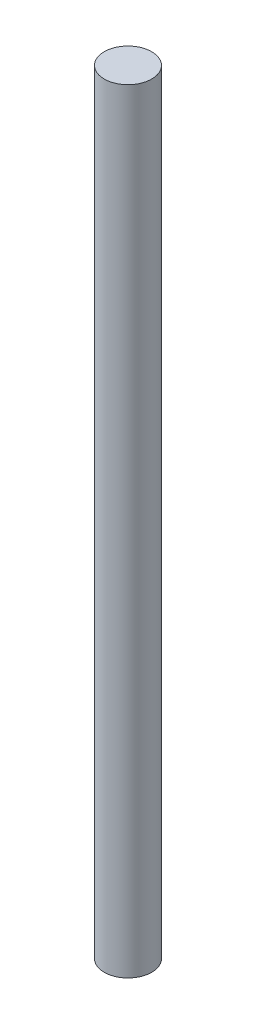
ISO-10303-21;
HEADER;
FILE_DESCRIPTION(('STEP AP214'),'2;1');
FILE_NAME('part.step','',(''),(''),'','','');
FILE_SCHEMA(('AUTOMOTIVE_DESIGN { 1 0 10303 214 1 1 1 1 }'));
ENDSEC;
DATA;
#1=APPLICATION_CONTEXT('core data for automotive mechanical design processes');
#2=APPLICATION_PROTOCOL_DEFINITION('international standard','automotive_design',2000,#1);
#3=PRODUCT_CONTEXT('',#1,'mechanical');
#4=PRODUCT('Part','Part','',(#3));
#5=PRODUCT_RELATED_PRODUCT_CATEGORY('part','',(#4));
#6=PRODUCT_DEFINITION_FORMATION('','',#4);
#7=PRODUCT_DEFINITION_CONTEXT('part definition',#1,'design');
#8=PRODUCT_DEFINITION('design','',#6,#7);
#9=PRODUCT_DEFINITION_SHAPE('','',#8);
#10=(LENGTH_UNIT() NAMED_UNIT(*) SI_UNIT(.MILLI.,.METRE.));
#11=(NAMED_UNIT(*) PLANE_ANGLE_UNIT() SI_UNIT($,.RADIAN.));
#12=(NAMED_UNIT(*) SI_UNIT($,.STERADIAN.) SOLID_ANGLE_UNIT());
#13=UNCERTAINTY_MEASURE_WITH_UNIT(LENGTH_MEASURE(1.E-05),#10,'distance_accuracy_value','');
#14=(GEOMETRIC_REPRESENTATION_CONTEXT(3) GLOBAL_UNCERTAINTY_ASSIGNED_CONTEXT((#13)) GLOBAL_UNIT_ASSIGNED_CONTEXT((#10,
#11,#12)) REPRESENTATION_CONTEXT('',''));
#15=CARTESIAN_POINT('',(0.,0.,0.));
#16=DIRECTION('',(0.,0.,1.));
#17=DIRECTION('',(1.,0.,0.));
#18=AXIS2_PLACEMENT_3D('',#15,#16,#17);
#19=CARTESIAN_POINT('',(0.,393.7,0.));
#20=DIRECTION('',(0.,-1.,0.));
#21=DIRECTION('',(0.,0.,-1.));
#22=AXIS2_PLACEMENT_3D('',#19,#20,#21);
#23=CYLINDRICAL_SURFACE('',#22,12.065);
#24=CARTESIAN_POINT('',(0.,393.7,0.));
#25=DIRECTION('',(0.,1.,0.));
#26=DIRECTION('',(0.,0.,1.));
#27=AXIS2_PLACEMENT_3D('',#24,#25,#26);
#28=CIRCLE('',#27,12.065);
#29=CARTESIAN_POINT('',(0.,393.7,12.065));
#30=VERTEX_POINT('',#29);
#31=EDGE_CURVE('E12',#30,#30,#28,.T.);
#32=ORIENTED_EDGE('',*,*,#31,.F.);
#33=EDGE_LOOP('',(#32));
#34=FACE_BOUND('',#33,.T.);
#35=CARTESIAN_POINT('',(0.,0.,0.));
#36=DIRECTION('',(0.,1.,0.));
#37=DIRECTION('',(0.,0.,1.));
#38=AXIS2_PLACEMENT_3D('',#35,#36,#37);
#39=CIRCLE('',#38,12.065);
#40=CARTESIAN_POINT('',(0.,0.,12.065));
#41=VERTEX_POINT('',#40);
#42=EDGE_CURVE('E48',#41,#41,#39,.T.);
#43=ORIENTED_EDGE('',*,*,#42,.T.);
#44=EDGE_LOOP('',(#43));
#45=FACE_BOUND('',#44,.T.);
#46=ADVANCED_FACE('F45',(#34,#45),#23,.T.);
#47=CARTESIAN_POINT('',(0.,393.7,0.));
#48=DIRECTION('',(0.,1.,0.));
#49=DIRECTION('',(0.,0.,1.));
#50=AXIS2_PLACEMENT_3D('',#47,#48,#49);
#51=PLANE('',#50);
#52=ORIENTED_EDGE('',*,*,#31,.T.);
#53=EDGE_LOOP('',(#52));
#54=FACE_BOUND('',#53,.T.);
#55=ADVANCED_FACE('F60',(#54),#51,.T.);
#56=CARTESIAN_POINT('',(0.,0.,0.));
#57=DIRECTION('',(0.,1.,0.));
#58=DIRECTION('',(0.,0.,1.));
#59=AXIS2_PLACEMENT_3D('',#56,#57,#58);
#60=PLANE('',#59);
#61=ORIENTED_EDGE('',*,*,#42,.F.);
#62=EDGE_LOOP('',(#61));
#63=FACE_BOUND('',#62,.T.);
#64=ADVANCED_FACE('F58',(#63),#60,.F.);
#65=CLOSED_SHELL('',(#46,#55,#64));
#66=MANIFOLD_SOLID_BREP('B2',#65);
#67=ADVANCED_BREP_SHAPE_REPRESENTATION('',(#18,#66),#14);
#68=SHAPE_DEFINITION_REPRESENTATION(#9,#67);
ENDSEC;
END-ISO-10303-21;
